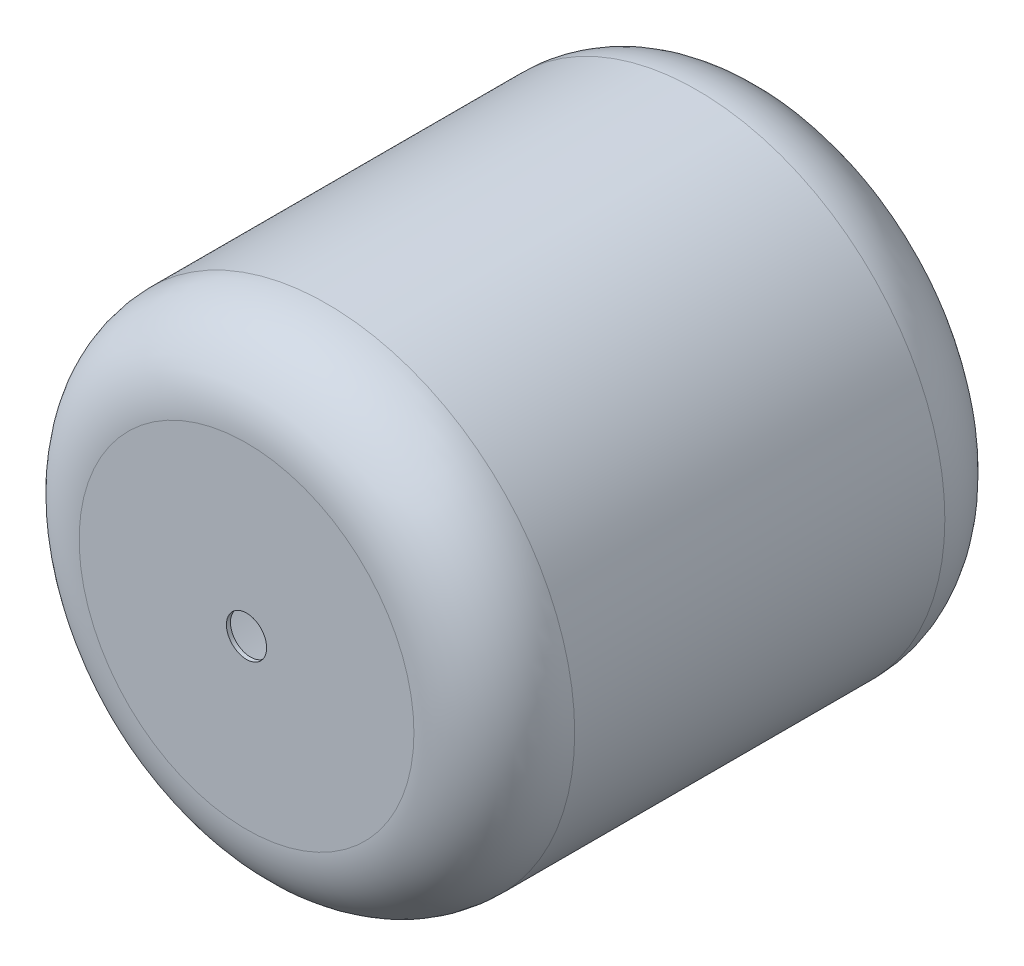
ISO-10303-21;
HEADER;
FILE_DESCRIPTION(('STEP AP214'),'2;1');
FILE_NAME('part.step','',(''),(''),'','','');
FILE_SCHEMA(('AUTOMOTIVE_DESIGN { 1 0 10303 214 1 1 1 1 }'));
ENDSEC;
DATA;
#1=APPLICATION_CONTEXT('core data for automotive mechanical design processes');
#2=APPLICATION_PROTOCOL_DEFINITION('international standard','automotive_design',2000,#1);
#3=PRODUCT_CONTEXT('',#1,'mechanical');
#4=PRODUCT('Part','Part','',(#3));
#5=PRODUCT_RELATED_PRODUCT_CATEGORY('part','',(#4));
#6=PRODUCT_DEFINITION_FORMATION('','',#4);
#7=PRODUCT_DEFINITION_CONTEXT('part definition',#1,'design');
#8=PRODUCT_DEFINITION('design','',#6,#7);
#9=PRODUCT_DEFINITION_SHAPE('','',#8);
#10=(LENGTH_UNIT() NAMED_UNIT(*) SI_UNIT(.MILLI.,.METRE.));
#11=(NAMED_UNIT(*) PLANE_ANGLE_UNIT() SI_UNIT($,.RADIAN.));
#12=(NAMED_UNIT(*) SI_UNIT($,.STERADIAN.) SOLID_ANGLE_UNIT());
#13=UNCERTAINTY_MEASURE_WITH_UNIT(LENGTH_MEASURE(1.E-05),#10,'distance_accuracy_value','');
#14=(GEOMETRIC_REPRESENTATION_CONTEXT(3) GLOBAL_UNCERTAINTY_ASSIGNED_CONTEXT((#13)) GLOBAL_UNIT_ASSIGNED_CONTEXT((#10,
#11,#12)) REPRESENTATION_CONTEXT('',''));
#15=CARTESIAN_POINT('',(0.,0.,0.));
#16=DIRECTION('',(0.,0.,1.));
#17=DIRECTION('',(1.,0.,0.));
#18=AXIS2_PLACEMENT_3D('',#15,#16,#17);
#19=CARTESIAN_POINT('',(0.,0.,335.534));
#20=DIRECTION('',(0.,0.,-1.));
#21=DIRECTION('',(-1.,0.,0.));
#22=AXIS2_PLACEMENT_3D('',#19,#20,#21);
#23=CYLINDRICAL_SURFACE('',#22,154.051);
#24=CARTESIAN_POINT('',(0.,0.,50.8));
#25=DIRECTION('',(0.,0.,-1.));
#26=DIRECTION('',(-1.,0.,0.));
#27=AXIS2_PLACEMENT_3D('',#24,#25,#26);
#28=CIRCLE('',#27,154.051);
#29=CARTESIAN_POINT('',(-154.051,0.,50.8));
#30=VERTEX_POINT('',#29);
#31=EDGE_CURVE('E52',#30,#30,#28,.F.);
#32=ORIENTED_EDGE('',*,*,#31,.F.);
#33=EDGE_LOOP('',(#32));
#34=FACE_BOUND('',#33,.T.);
#35=CARTESIAN_POINT('',(0.,0.,284.734));
#36=DIRECTION('',(0.,0.,-1.));
#37=DIRECTION('',(-1.,0.,0.));
#38=AXIS2_PLACEMENT_3D('',#35,#36,#37);
#39=CIRCLE('',#38,154.051);
#40=CARTESIAN_POINT('',(-154.051,0.,284.734));
#41=VERTEX_POINT('',#40);
#42=EDGE_CURVE('E45',#41,#41,#39,.T.);
#43=ORIENTED_EDGE('',*,*,#42,.F.);
#44=EDGE_LOOP('',(#43));
#45=FACE_BOUND('',#44,.T.);
#46=ADVANCED_FACE('F32',(#34,#45),#23,.F.);
#47=CARTESIAN_POINT('',(0.,0.,332.994));
#48=DIRECTION('',(0.,0.,1.));
#49=DIRECTION('',(1.,0.,0.));
#50=AXIS2_PLACEMENT_3D('',#47,#48,#49);
#51=PLANE('',#50);
#52=CARTESIAN_POINT('',(0.,0.,332.994));
#53=DIRECTION('',(0.,0.,1.));
#54=DIRECTION('',(1.,0.,0.));
#55=AXIS2_PLACEMENT_3D('',#52,#53,#54);
#56=CIRCLE('',#55,12.7);
#57=CARTESIAN_POINT('',(12.7,0.,332.994));
#58=VERTEX_POINT('',#57);
#59=EDGE_CURVE('E36',#58,#58,#56,.T.);
#60=ORIENTED_EDGE('',*,*,#59,.T.);
#61=EDGE_LOOP('',(#60));
#62=FACE_BOUND('',#61,.T.);
#63=CARTESIAN_POINT('',(0.,0.,332.994));
#64=DIRECTION('',(0.,0.,1.));
#65=DIRECTION('',(1.,0.,0.));
#66=AXIS2_PLACEMENT_3D('',#63,#64,#65);
#67=CIRCLE('',#66,105.791);
#68=CARTESIAN_POINT('',(105.791,0.,332.994));
#69=VERTEX_POINT('',#68);
#70=EDGE_CURVE('E40',#69,#69,#67,.T.);
#71=ORIENTED_EDGE('',*,*,#70,.F.);
#72=EDGE_LOOP('',(#71));
#73=FACE_BOUND('',#72,.T.);
#74=ADVANCED_FACE('F77',(#62,#73),#51,.F.);
#75=CARTESIAN_POINT('',(0.,0.,2.54));
#76=DIRECTION('',(0.,0.,1.));
#77=DIRECTION('',(1.,0.,0.));
#78=AXIS2_PLACEMENT_3D('',#75,#76,#77);
#79=PLANE('',#78);
#80=CARTESIAN_POINT('',(0.,0.,2.54000000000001));
#81=DIRECTION('',(0.,0.,1.));
#82=DIRECTION('',(1.,0.,0.));
#83=AXIS2_PLACEMENT_3D('',#80,#81,#82);
#84=CIRCLE('',#83,105.791);
#85=CARTESIAN_POINT('',(105.791,0.,2.54000000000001));
#86=VERTEX_POINT('',#85);
#87=EDGE_CURVE('E10',#86,#86,#84,.F.);
#88=ORIENTED_EDGE('',*,*,#87,.F.);
#89=EDGE_LOOP('',(#88));
#90=FACE_BOUND('',#89,.T.);
#91=ADVANCED_FACE('F98',(#90),#79,.T.);
#92=CARTESIAN_POINT('',(0.,0.,284.734));
#93=DIRECTION('',(0.,0.,1.));
#94=DIRECTION('',(1.,0.,0.));
#95=AXIS2_PLACEMENT_3D('',#92,#93,#94);
#96=TOROIDAL_SURFACE('',#95,105.791,48.26);
#97=ORIENTED_EDGE('',*,*,#42,.T.);
#98=EDGE_LOOP('',(#97));
#99=FACE_BOUND('',#98,.T.);
#100=ORIENTED_EDGE('',*,*,#70,.T.);
#101=EDGE_LOOP('',(#100));
#102=FACE_BOUND('',#101,.T.);
#103=ADVANCED_FACE('F90',(#99,#102),#96,.F.);
#104=CARTESIAN_POINT('',(0.,0.,50.8));
#105=DIRECTION('',(0.,0.,1.));
#106=DIRECTION('',(1.,0.,0.));
#107=AXIS2_PLACEMENT_3D('',#104,#105,#106);
#108=TOROIDAL_SURFACE('',#107,105.791,48.26);
#109=ORIENTED_EDGE('',*,*,#87,.T.);
#110=EDGE_LOOP('',(#109));
#111=FACE_BOUND('',#110,.T.);
#112=ORIENTED_EDGE('',*,*,#31,.T.);
#113=EDGE_LOOP('',(#112));
#114=FACE_BOUND('',#113,.T.);
#115=ADVANCED_FACE('F34',(#111,#114),#108,.F.);
#116=CARTESIAN_POINT('',(0.,0.,254.));
#117=DIRECTION('',(0.,0.,1.));
#118=DIRECTION('',(1.,0.,0.));
#119=AXIS2_PLACEMENT_3D('',#116,#117,#118);
#120=CYLINDRICAL_SURFACE('',#119,12.7);
#121=CARTESIAN_POINT('',(0.,0.,335.534));
#122=DIRECTION('',(0.,0.,1.));
#123=DIRECTION('',(1.,0.,0.));
#124=AXIS2_PLACEMENT_3D('',#121,#122,#123);
#125=CIRCLE('',#124,12.7);
#126=CARTESIAN_POINT('',(12.7,0.,335.534));
#127=VERTEX_POINT('',#126);
#128=EDGE_CURVE('E70',#127,#127,#125,.T.);
#129=ORIENTED_EDGE('',*,*,#128,.T.);
#130=EDGE_LOOP('',(#129));
#131=FACE_BOUND('',#130,.T.);
#132=ORIENTED_EDGE('',*,*,#59,.F.);
#133=EDGE_LOOP('',(#132));
#134=FACE_BOUND('',#133,.T.);
#135=ADVANCED_FACE('F80',(#131,#134),#120,.F.);
#136=CARTESIAN_POINT('',(0.,0.,335.534));
#137=DIRECTION('',(0.,0.,-1.));
#138=DIRECTION('',(-1.,0.,0.));
#139=AXIS2_PLACEMENT_3D('',#136,#137,#138);
#140=CYLINDRICAL_SURFACE('',#139,156.591);
#141=CARTESIAN_POINT('',(0.,0.,50.8));
#142=DIRECTION('',(0.,0.,1.));
#143=DIRECTION('',(1.,0.,0.));
#144=AXIS2_PLACEMENT_3D('',#141,#142,#143);
#145=CIRCLE('',#144,156.591);
#146=CARTESIAN_POINT('',(156.591,0.,50.8));
#147=VERTEX_POINT('',#146);
#148=EDGE_CURVE('E57',#147,#147,#145,.T.);
#149=ORIENTED_EDGE('',*,*,#148,.T.);
#150=EDGE_LOOP('',(#149));
#151=FACE_BOUND('',#150,.T.);
#152=CARTESIAN_POINT('',(0.,0.,284.734));
#153=DIRECTION('',(0.,0.,1.));
#154=DIRECTION('',(1.,0.,0.));
#155=AXIS2_PLACEMENT_3D('',#152,#153,#154);
#156=CIRCLE('',#155,156.591);
#157=CARTESIAN_POINT('',(156.591,0.,284.734));
#158=VERTEX_POINT('',#157);
#159=EDGE_CURVE('E61',#158,#158,#156,.F.);
#160=ORIENTED_EDGE('',*,*,#159,.T.);
#161=EDGE_LOOP('',(#160));
#162=FACE_BOUND('',#161,.T.);
#163=ADVANCED_FACE('F82',(#151,#162),#140,.T.);
#164=CARTESIAN_POINT('',(0.,0.,335.534));
#165=DIRECTION('',(0.,0.,1.));
#166=DIRECTION('',(1.,0.,0.));
#167=AXIS2_PLACEMENT_3D('',#164,#165,#166);
#168=PLANE('',#167);
#169=ORIENTED_EDGE('',*,*,#128,.F.);
#170=EDGE_LOOP('',(#169));
#171=FACE_BOUND('',#170,.T.);
#172=CARTESIAN_POINT('',(0.,0.,335.534));
#173=DIRECTION('',(0.,0.,1.));
#174=DIRECTION('',(1.,0.,0.));
#175=AXIS2_PLACEMENT_3D('',#172,#173,#174);
#176=CIRCLE('',#175,105.791);
#177=CARTESIAN_POINT('',(105.791,0.,335.534));
#178=VERTEX_POINT('',#177);
#179=EDGE_CURVE('E65',#178,#178,#176,.T.);
#180=ORIENTED_EDGE('',*,*,#179,.T.);
#181=EDGE_LOOP('',(#180));
#182=FACE_BOUND('',#181,.T.);
#183=ADVANCED_FACE('F88',(#171,#182),#168,.T.);
#184=CARTESIAN_POINT('',(0.,0.,0.));
#185=DIRECTION('',(0.,0.,1.));
#186=DIRECTION('',(1.,0.,0.));
#187=AXIS2_PLACEMENT_3D('',#184,#185,#186);
#188=PLANE('',#187);
#189=CARTESIAN_POINT('',(0.,0.,0.));
#190=DIRECTION('',(0.,0.,1.));
#191=DIRECTION('',(1.,0.,0.));
#192=AXIS2_PLACEMENT_3D('',#189,#190,#191);
#193=CIRCLE('',#192,105.791);
#194=CARTESIAN_POINT('',(105.791,0.,0.));
#195=VERTEX_POINT('',#194);
#196=EDGE_CURVE('E48',#195,#195,#193,.F.);
#197=ORIENTED_EDGE('',*,*,#196,.T.);
#198=EDGE_LOOP('',(#197));
#199=FACE_BOUND('',#198,.T.);
#200=ADVANCED_FACE('F137',(#199),#188,.F.);
#201=CARTESIAN_POINT('',(0.,0.,284.734));
#202=DIRECTION('',(0.,0.,1.));
#203=DIRECTION('',(1.,0.,0.));
#204=AXIS2_PLACEMENT_3D('',#201,#202,#203);
#205=TOROIDAL_SURFACE('',#204,105.791,50.8);
#206=ORIENTED_EDGE('',*,*,#159,.F.);
#207=EDGE_LOOP('',(#206));
#208=FACE_BOUND('',#207,.T.);
#209=ORIENTED_EDGE('',*,*,#179,.F.);
#210=EDGE_LOOP('',(#209));
#211=FACE_BOUND('',#210,.T.);
#212=ADVANCED_FACE('F146',(#208,#211),#205,.T.);
#213=CARTESIAN_POINT('',(0.,0.,50.8));
#214=DIRECTION('',(0.,0.,1.));
#215=DIRECTION('',(1.,0.,0.));
#216=AXIS2_PLACEMENT_3D('',#213,#214,#215);
#217=TOROIDAL_SURFACE('',#216,105.791,50.8);
#218=ORIENTED_EDGE('',*,*,#196,.F.);
#219=EDGE_LOOP('',(#218));
#220=FACE_BOUND('',#219,.T.);
#221=ORIENTED_EDGE('',*,*,#148,.F.);
#222=EDGE_LOOP('',(#221));
#223=FACE_BOUND('',#222,.T.);
#224=ADVANCED_FACE('F155',(#220,#223),#217,.T.);
#225=CLOSED_SHELL('',(#46,#74,#91,#103,#115,#135,#163,#183,#200,#212,#224));
#226=MANIFOLD_SOLID_BREP('B2',#225);
#227=ADVANCED_BREP_SHAPE_REPRESENTATION('',(#18,#226),#14);
#228=SHAPE_DEFINITION_REPRESENTATION(#9,#227);
ENDSEC;
END-ISO-10303-21;
